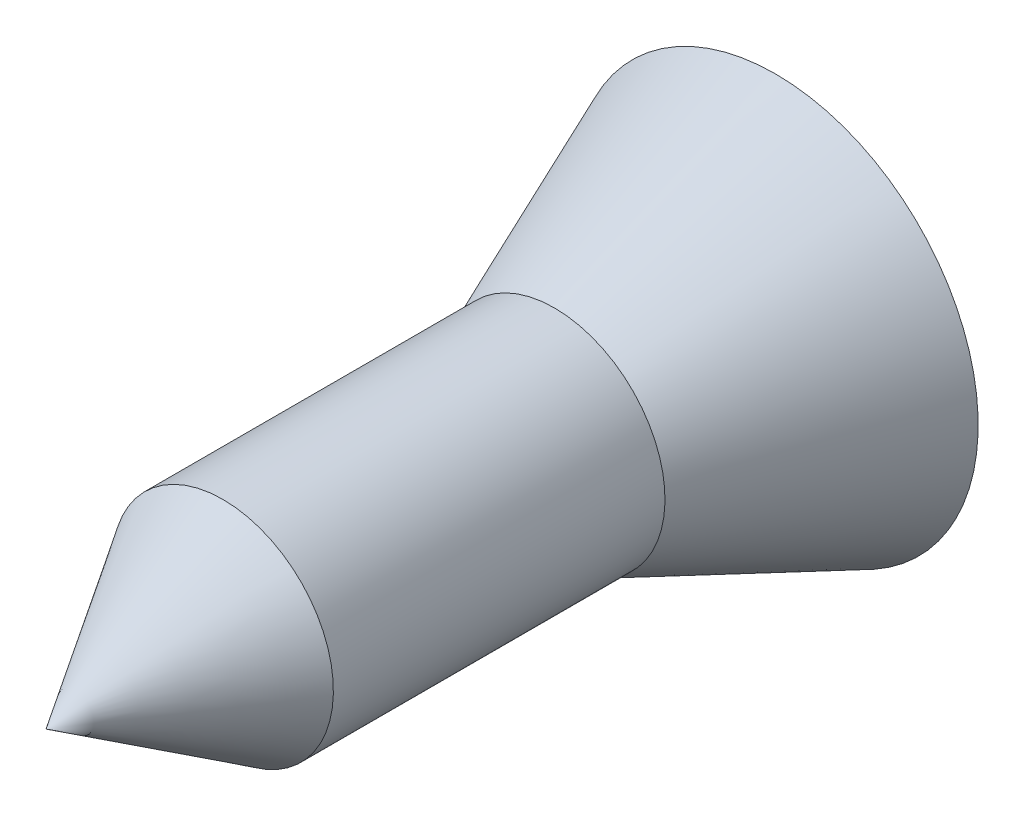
ISO-10303-21;
HEADER;
FILE_DESCRIPTION(('STEP AP214'),'2;1');
FILE_NAME('part.step','',(''),(''),'','','');
FILE_SCHEMA(('AUTOMOTIVE_DESIGN { 1 0 10303 214 1 1 1 1 }'));
ENDSEC;
DATA;
#1=APPLICATION_CONTEXT('core data for automotive mechanical design processes');
#2=APPLICATION_PROTOCOL_DEFINITION('international standard','automotive_design',2000,#1);
#3=PRODUCT_CONTEXT('',#1,'mechanical');
#4=PRODUCT('Part','Part','',(#3));
#5=PRODUCT_RELATED_PRODUCT_CATEGORY('part','',(#4));
#6=PRODUCT_DEFINITION_FORMATION('','',#4);
#7=PRODUCT_DEFINITION_CONTEXT('part definition',#1,'design');
#8=PRODUCT_DEFINITION('design','',#6,#7);
#9=PRODUCT_DEFINITION_SHAPE('','',#8);
#10=(LENGTH_UNIT() NAMED_UNIT(*) SI_UNIT(.MILLI.,.METRE.));
#11=(NAMED_UNIT(*) PLANE_ANGLE_UNIT() SI_UNIT($,.RADIAN.));
#12=(NAMED_UNIT(*) SI_UNIT($,.STERADIAN.) SOLID_ANGLE_UNIT());
#13=UNCERTAINTY_MEASURE_WITH_UNIT(LENGTH_MEASURE(1.E-05),#10,'distance_accuracy_value','');
#14=(GEOMETRIC_REPRESENTATION_CONTEXT(3) GLOBAL_UNCERTAINTY_ASSIGNED_CONTEXT((#13)) GLOBAL_UNIT_ASSIGNED_CONTEXT((#10,
#11,#12)) REPRESENTATION_CONTEXT('',''));
#15=CARTESIAN_POINT('',(0.,0.,0.));
#16=DIRECTION('',(0.,0.,1.));
#17=DIRECTION('',(1.,0.,0.));
#18=AXIS2_PLACEMENT_3D('',#15,#16,#17);
#19=CARTESIAN_POINT('',(1.40000000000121,0.,-3.4));
#20=DIRECTION('',(0.,0.,-1.));
#21=DIRECTION('',(0.,1.,0.));
#22=AXIS2_PLACEMENT_3D('',#19,#20,#21);
#23=PLANE('',#22);
#24=CARTESIAN_POINT('',(1.40000000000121,0.,-3.4));
#25=DIRECTION('',(0.,0.,-1.));
#26=DIRECTION('',(0.,1.,0.));
#27=AXIS2_PLACEMENT_3D('',#24,#25,#26);
#28=CIRCLE('',#27,2.75);
#29=CARTESIAN_POINT('',(1.40000000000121,2.75,-3.4));
#30=VERTEX_POINT('',#29);
#31=EDGE_CURVE('E11',#30,#30,#28,.T.);
#32=ORIENTED_EDGE('',*,*,#31,.T.);
#33=EDGE_LOOP('',(#32));
#34=FACE_BOUND('',#33,.T.);
#35=ADVANCED_FACE('F32',(#34),#23,.T.);
#36=CARTESIAN_POINT('',(1.40000000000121,0.,-3.4));
#37=DIRECTION('',(0.,0.,-1.));
#38=DIRECTION('',(0.,1.,0.));
#39=AXIS2_PLACEMENT_3D('',#36,#37,#38);
#40=CONICAL_SURFACE('',#39,2.75,0.394791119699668);
#41=CARTESIAN_POINT('',(1.40000000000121,0.,-0.399999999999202));
#42=DIRECTION('',(0.,0.,-1.));
#43=DIRECTION('',(0.,1.,0.));
#44=AXIS2_PLACEMENT_3D('',#41,#42,#43);
#45=CIRCLE('',#44,1.5);
#46=CARTESIAN_POINT('',(1.40000000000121,1.5,-0.399999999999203));
#47=VERTEX_POINT('',#46);
#48=EDGE_CURVE('E38',#47,#47,#45,.T.);
#49=ORIENTED_EDGE('',*,*,#48,.T.);
#50=EDGE_LOOP('',(#49));
#51=FACE_BOUND('',#50,.T.);
#52=ORIENTED_EDGE('',*,*,#31,.F.);
#53=EDGE_LOOP('',(#52));
#54=FACE_BOUND('',#53,.T.);
#55=ADVANCED_FACE('F54',(#51,#54),#40,.T.);
#56=CARTESIAN_POINT('',(1.40000000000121,0.,6.5));
#57=DIRECTION('',(0.,0.,-1.));
#58=DIRECTION('',(0.,1.,0.));
#59=AXIS2_PLACEMENT_3D('',#56,#57,#58);
#60=CYLINDRICAL_SURFACE('',#59,1.5);
#61=CARTESIAN_POINT('',(1.40000000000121,0.,4.1));
#62=DIRECTION('',(0.,0.,-1.));
#63=DIRECTION('',(0.,1.,0.));
#64=AXIS2_PLACEMENT_3D('',#61,#62,#63);
#65=CIRCLE('',#64,1.5);
#66=CARTESIAN_POINT('',(1.40000000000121,1.5,4.1));
#67=VERTEX_POINT('',#66);
#68=EDGE_CURVE('E48',#67,#67,#65,.T.);
#69=ORIENTED_EDGE('',*,*,#68,.T.);
#70=EDGE_LOOP('',(#69));
#71=FACE_BOUND('',#70,.T.);
#72=ORIENTED_EDGE('',*,*,#48,.F.);
#73=EDGE_LOOP('',(#72));
#74=FACE_BOUND('',#73,.T.);
#75=ADVANCED_FACE('F44',(#71,#74),#60,.T.);
#76=CARTESIAN_POINT('',(1.40000000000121,0.,4.1));
#77=DIRECTION('',(0.,0.,-1.));
#78=DIRECTION('',(0.,1.,0.));
#79=AXIS2_PLACEMENT_3D('',#76,#77,#78);
#80=CONICAL_SURFACE('',#79,1.5,0.558599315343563);
#81=CARTESIAN_POINT('',(1.40000000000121,0.,6.5));
#82=VERTEX_POINT('',#81);
#83=VERTEX_LOOP('',#82);
#84=FACE_BOUND('',#83,.T.);
#85=ORIENTED_EDGE('',*,*,#68,.F.);
#86=EDGE_LOOP('',(#85));
#87=FACE_BOUND('',#86,.T.);
#88=ADVANCED_FACE('F41',(#84,#87),#80,.T.);
#89=CLOSED_SHELL('',(#35,#55,#75,#88));
#90=MANIFOLD_SOLID_BREP('B2',#89);
#91=ADVANCED_BREP_SHAPE_REPRESENTATION('',(#18,#90),#14);
#92=SHAPE_DEFINITION_REPRESENTATION(#9,#91);
ENDSEC;
END-ISO-10303-21;
